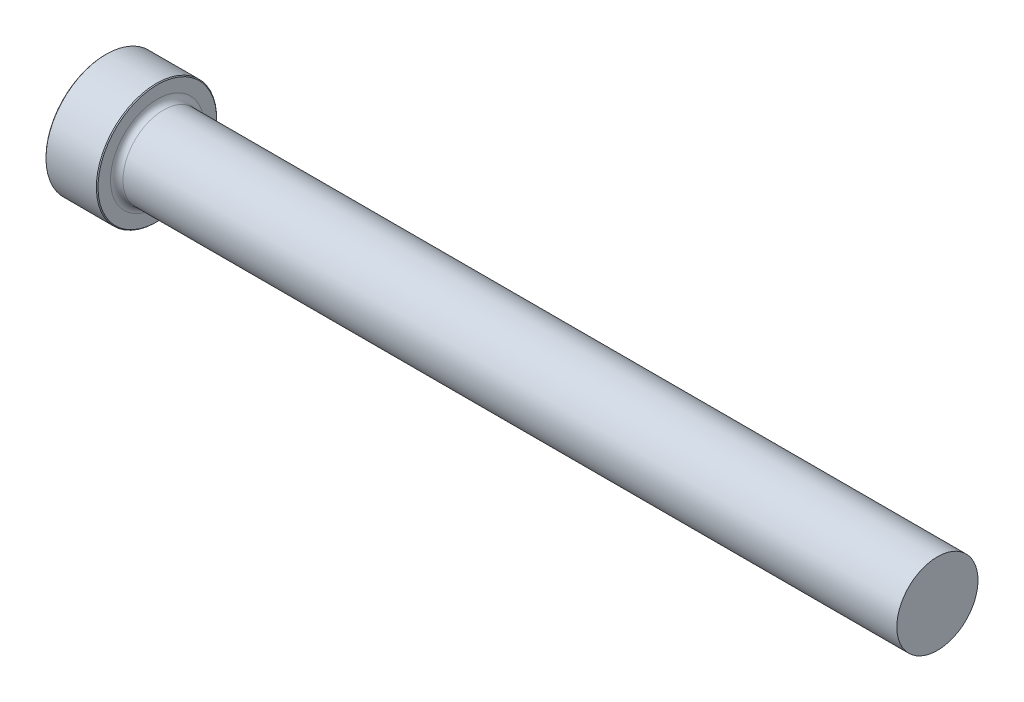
from build123d import *

# Parameters (mm, degrees)
CHAMFER1_SIZE = 0.1016


with BuildPart() as part:
    # Sketch1 → Revolve1 (revolve)
    with BuildSketch(Plane.XY):
        with BuildLine():
            Line((0, 0), (0, 7.3421875))
            Line((0, 7.3421875), (6.35, 7.3421875))
            Line((6.35, 7.3421875), (6.35, 5.7191275))
            ThreePointArc((6.35, 5.7191275), (6.573184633, 5.180312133), (7.112, 4.9571275))
            Line((7.112, 4.9571275), (101.6, 4.9571275))
            Line((101.6, 4.9571275), (101.6, 0))
            Line((101.6, 0), (0, 0))
        make_face()
    revolve(axis=Axis((101.6, 0, 0), (-1, 0, 0)))

    # Chamfer1
    chamfer1_edges = [part.edges().sort_by_distance(p)[0] for p in [
        (0, -7.3421875, 0),
        (6.35, -7.3421875, 0),
    ]]
    chamfer(chamfer1_edges, length=CHAMFER1_SIZE)


solid = part.part
